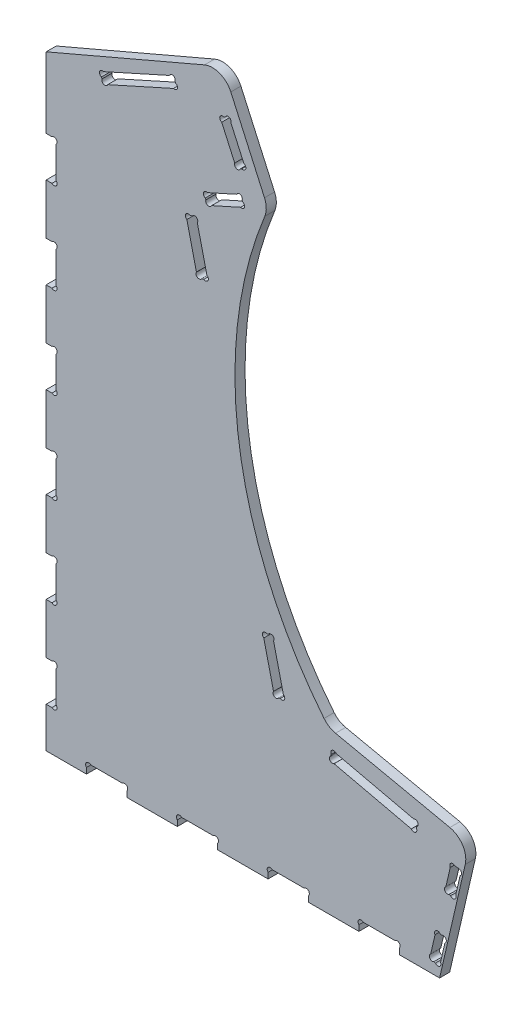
from build123d import *

# Parameters (mm, degrees)
SALIENTE_EXTRUIR3_DEPTH     = 10
CORTAR_EXTRUIR1_DEPTH       = 10
MATRIZL1_COUNT              = 4
MATRIZL1_PITCH              = 90
CROQUIS3_W                  = 10
CROQUIS3_H                  = 40
CORTAR_EXTRUIR2_DEPTH       = 788.723503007
CROQUIS4_R                  = 3
CORTAR_EXTRUIR3_DEPTH       = 788.723503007
MATRIZL2_COUNT              = 6
MATRIZL2_PITCH              = 90
CORTAR_EXTRUIR4_DEPTH       = 10
CORTAR_EXTRUIR5_DEPTH       = 788.723503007
MATRIZL3_COUNT              = 2
MATRIZL3_PITCH              = 67
CORTAR_EXTRUIR6_DEPTH       = 788.723503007
CORTAR_EXTRUIR7_DEPTH       = 788.723503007
CORTAR_EXTRUIR7_DEPTH_BACK  = 788.723503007
CROQUIS9_R                  = 3
CORTAR_EXTRUIR8_DEPTH       = 788.723503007
SIMETR_A2_COPY_1_SKETCH_R   = 3
SIMETR_A2_COPY_1_DEPTH      = 788.723503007
CROQUIS10_R                 = 3
CORTAR_EXTRUIR9_DEPTH       = 788.723503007
SIMETR_A4_COPY_1_SKETCH_R   = 3
SIMETR_A4_COPY_1_DEPTH      = 788.723503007
CORTAR_EXTRUIR10_DEPTH      = 788.723503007
CORTAR_EXTRUIR10_DEPTH_BACK = 788.723503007
CROQUIS12_R                 = 3
CORTAR_EXTRUIR11_DEPTH      = 788.723503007
SIMETR_A7_COPY_1_SKETCH_R   = 3
SIMETR_A7_COPY_1_DEPTH      = 788.723503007
CORTAR_EXTRUIR12_DEPTH      = 788.723503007
CORTAR_EXTRUIR12_DEPTH_BACK = 788.723503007
CROQUIS14_R                 = 3
CORTAR_EXTRUIR13_DEPTH      = 788.723503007
SIMETR_A9_COPY_1_SKETCH_R   = 3
SIMETR_A9_COPY_1_DEPTH      = 788.723503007
CROQUIS15_R                 = 3
CORTAR_EXTRUIR14_DEPTH      = 788.723503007
SIMETR_A11_COPY_1_SKETCH_R  = 3
SIMETR_A11_COPY_1_DEPTH     = 788.723503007
CORTAR_EXTRUIR15_DEPTH      = 788.723503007
CROQUIS17_R                 = 3
CORTAR_EXTRUIR16_DEPTH      = 788.723503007
SIMETR_A13_COPY_1_SKETCH_R  = 3
SIMETR_A13_COPY_1_DEPTH     = 788.723503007


with BuildPart() as part:
    # Croquis1 → Saliente-Extruir3 (new body)
    with BuildSketch(Plane.XY):
        with BuildLine():
            Line((390, 0), (0, 0))
            Line((0, 0), (0, 600))
            Line((0, 600), (156.944365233, 667.261870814))
            ThreePointArc((156.944365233, 667.261870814), (172.083493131, 667.514463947), (183.061181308, 657.08626376))
            Line((183.061181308, 657.08626376), (216.431669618, 582.92962307))
            ThreePointArc((216.431669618, 582.92962307), (218.190009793, 575.081743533), (216.714823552, 567.175745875))
            ThreePointArc((216.714823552, 567.175745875), (191.356561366, 358.362114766), (275.449490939, 165.555078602))
            ThreePointArc((275.449490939, 165.555078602), (280.54183744, 161.062862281), (286.843759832, 158.533480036))
            Line((286.843759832, 158.533480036), (400.13437653, 134.256919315))
            ThreePointArc((400.13437653, 134.256919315), (412.819999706, 125.433704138), (415.431618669, 110.2036809))
            Line((415.431618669, 110.2036809), (390, 0))
        make_face()
    extrude(amount=SALIENTE_EXTRUIR3_DEPTH)

    # Croquis2 → Cortar-Extruir1 (cut)
    with BuildSketch(Plane(origin=(496.247325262, 245.408483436, 0), x_dir=(-1, 0, 0), z_dir=(0, 0, -1))):
        with BuildLine():
            Line((456.247325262, -245.408483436), (416.247325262, -245.408483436))
            Line((416.247325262, -245.408483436), (416.247325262, -239.651124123))
            ThreePointArc((416.247325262, -239.651124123), (416.247325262, -235.408483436), (420.489965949, -235.408483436))
            Line((420.489965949, -235.408483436), (452.004684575, -235.408483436))
            ThreePointArc((452.004684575, -235.408483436), (456.247325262, -235.408483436), (456.247325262, -239.651124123))
            Line((456.247325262, -239.651124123), (456.247325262, -245.408483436))
        make_face()
    cortar_extruir1 = extrude(amount=-CORTAR_EXTRUIR1_DEPTH, mode=Mode.SUBTRACT)

    # MatrizL1: Cortar-Extruir1 ×4
    with Locations(*[(i * MATRIZL1_PITCH, 0, 0) for i in range(1, MATRIZL1_COUNT)]):
        add(cortar_extruir1, mode=Mode.SUBTRACT)

    # Croquis3 → Cortar-Extruir2 (cut, through all)
    with BuildSketch(Plane(origin=(0, 0, 0), x_dir=(-1, 0, 0), z_dir=(0, 0, -1))):
        with Locations((-5, 60)):
            Rectangle(CROQUIS3_W, CROQUIS3_H)
    cortar_extruir2 = extrude(amount=-CORTAR_EXTRUIR2_DEPTH, mode=Mode.SUBTRACT)

    # Croquis4 → Cortar-Extruir3 (cut, symmetric)
    with BuildSketch(Plane(origin=(0, 0, 0), x_dir=(-1, 0, 0), z_dir=(0, 0, -1))):
        with Locations((-7.878679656, 42.121320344)):
            Circle(CROQUIS4_R)
        with Locations((-7.878679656, 77.878679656)):
            Circle(CROQUIS4_R)
    cortar_extruir3 = extrude(amount=CORTAR_EXTRUIR3_DEPTH, both=True, mode=Mode.SUBTRACT)

    # MatrizL2: Cortar-Extruir2, Cortar-Extruir3 ×6
    with Locations(*[(0, i * MATRIZL2_PITCH, 0) for i in range(1, MATRIZL2_COUNT)]):
        add(cortar_extruir2, mode=Mode.SUBTRACT)
        add(cortar_extruir3, mode=Mode.SUBTRACT)

    # Croquis5 → Cortar-Extruir4 (cut)
    with BuildSketch(Plane.XY.offset(10)):
        Polygon((386.439724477, 39.044352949), (396.183636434, 36.795757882), (389.968640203, 9.864107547), (380.224728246, 12.112702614), align=None)
        Polygon((401.617741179, 104.815758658), (411.361653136, 102.567163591), (405.041364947, 75.179248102), (395.29745299, 77.427843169), align=None)
    extrude(amount=-CORTAR_EXTRUIR4_DEPTH, mode=Mode.SUBTRACT)

    # Croquis6 → Cortar-Extruir5 (cut, symmetric)
    with BuildSketch(Plane(origin=(0, 0, 0), x_dir=(-1, 0, 0), z_dir=(0, 0, -1))):
        with BuildLine():
            ThreePointArc((-390.64478447, 35.030172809), (-385.10654771, 37.174936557), (-391.02457835, 36.67594629))
            ThreePointArc((-391.02457835, 36.67594629), (-396.562815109, 34.531182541), (-390.64478447, 35.030172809))
        make_face()
        with BuildLine():
            ThreePointArc((-385.763580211, 13.878287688), (-379.845549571, 14.377277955), (-385.383786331, 12.232514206))
            ThreePointArc((-385.383786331, 12.232514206), (-391.30181697, 11.733523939), (-385.763580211, 13.878287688))
        make_face()
    cortar_extruir5 = extrude(amount=CORTAR_EXTRUIR5_DEPTH, both=True, mode=Mode.SUBTRACT)

    # MatrizL3: Cortar-Extruir5 ×2
    with Locations(*[Vector(0.2248595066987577, 0.9743911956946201, 0) * (i * MATRIZL3_PITCH) for i in range(1, MATRIZL3_COUNT)]):
        add(cortar_extruir5, mode=Mode.SUBTRACT)

    # Croquis7 → Cortar-Extruir6 (cut, through all)
    with BuildSketch(Plane.XY.offset(10)):
        Polygon((281.280428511, 132.585907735), (283.529023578, 142.329819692), (368.285922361, 122.770535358), (366.037327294, 113.026623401), align=None)
    extrude(amount=-CORTAR_EXTRUIR6_DEPTH, mode=Mode.SUBTRACT)

    # Croquis8 → Cortar-Extruir7 (cut, two sides: drawn at the far end of the back side and taken through both)
    with BuildSketch(Plane.XY.offset(10).offset(-CORTAR_EXTRUIR7_DEPTH_BACK)):
        Polygon((214.741242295, 208.899562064), (224.475329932, 211.190312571), (236.079041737, 161.882652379), (226.344954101, 159.591901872), align=None)
        Polygon((148.880563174, 532.415204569), (160.334315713, 483.744766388), (149.944860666, 481.299786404), (138.491108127, 529.970224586), align=None)
    extrude(amount=CORTAR_EXTRUIR7_DEPTH + CORTAR_EXTRUIR7_DEPTH_BACK, mode=Mode.SUBTRACT)

    # Croquis9 → Cortar-Extruir8 (cut, symmetric)
    with BuildSketch(Plane(origin=(0, 0, 0), x_dir=(-1, 0, 0), z_dir=(0, 0, -1))):
        with Locations((-365.741927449, 121.180538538)):
            Circle(CROQUIS9_R)
    cortar_extruir8 = extrude(amount=CORTAR_EXTRUIR8_DEPTH, both=True, mode=Mode.SUBTRACT)

    # Simetr_a1: Cortar-Extruir8 across plane
    add(cortar_extruir8.mirror(Plane(origin=(280.387112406, -64.704718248, 0), x_dir=(0, 0, 1), z_dir=(-0.9743911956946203, 0.22485950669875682, 0))), mode=Mode.SUBTRACT)

    # Simetr_a2: Cortar-Extruir8 across plane
    add(cortar_extruir8.mirror(Plane(origin=(44.396063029, 192.382939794, 0), x_dir=(0, 0, 1), z_dir=(-0.22485950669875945, -0.9743911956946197, 0))), mode=Mode.SUBTRACT)

    # Simetr_a2 copy 1 sketch → Simetr_a2 copy 1 (cut, symmetric)
    with BuildSketch(Plane(origin=(649.566350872, 255.356443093, 0), x_dir=(1, 0, 0), z_dir=(0, 0, -1))):
        with Locations((-365.741927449, 121.180538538)):
            Circle(SIMETR_A2_COPY_1_SKETCH_R)
    extrude(amount=SIMETR_A2_COPY_1_DEPTH, both=True, mode=Mode.SUBTRACT)

    # Croquis10 → Cortar-Extruir9 (cut, symmetric)
    with BuildSketch(Plane(origin=(0, 0, 0), x_dir=(-1, 0, 0), z_dir=(0, 0, -1))):
        with Locations((-233.528188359, 163.461622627)):
            Circle(CROQUIS10_R)
    cortar_extruir9 = extrude(amount=CORTAR_EXTRUIR9_DEPTH, both=True, mode=Mode.SUBTRACT)

    # Simetr_a3: Cortar-Extruir9 across plane
    add(cortar_extruir9.mirror(Plane(origin=(254.920847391, 59.991247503, 0), x_dir=(0, 0, 1), z_dir=(-0.9734087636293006, -0.22907505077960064, 0))), mode=Mode.SUBTRACT)

    # Simetr_a4: Cortar-Extruir9 across plane
    add(cortar_extruir9.mirror(Plane(origin=(-29.510705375, 125.399859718, 0), x_dir=(0, 0, 1), z_dir=(-0.22907505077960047, 0.9734087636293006, 0))), mode=Mode.SUBTRACT)

    # Simetr_a4 copy 1 sketch → Simetr_a4 copy 1 (cut, symmetric)
    with BuildSketch(Plane(origin=(450.820284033, 370.782214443, 0), x_dir=(1, 0, 0), z_dir=(0, 0, -1))):
        with Locations((-233.528188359, 163.461622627)):
            Circle(SIMETR_A4_COPY_1_SKETCH_R)
    extrude(amount=SIMETR_A4_COPY_1_DEPTH, both=True, mode=Mode.SUBTRACT)

    # Croquis11 → Cortar-Extruir10 (cut, two sides: drawn at the far end of the back side and taken through both)
    with BuildSketch(Plane.XY.offset(10).offset(-CORTAR_EXTRUIR10_DEPTH_BACK)):
        Polygon((53.038071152, 609.709569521), (125.991791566, 642.538743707), (130.095438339, 633.419528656), (57.141717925, 600.590354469), align=None)
    extrude(amount=CORTAR_EXTRUIR10_DEPTH + CORTAR_EXTRUIR10_DEPTH_BACK, mode=Mode.SUBTRACT)

    # Croquis12 → Cortar-Extruir11 (cut, symmetric)
    with BuildSketch(Plane(origin=(0, 0, 0), x_dir=(-1, 0, 0), z_dir=(0, 0, -1))):
        with Locations((-127.29044576, 634.483491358)):
            Circle(CROQUIS12_R)
    cortar_extruir11 = extrude(amount=CORTAR_EXTRUIR11_DEPTH, both=True, mode=Mode.SUBTRACT)

    # Simetr_a6: Cortar-Extruir11 across plane
    add(cortar_extruir11.mirror(Plane(origin=(308.749107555, 138.9370984, 0), x_dir=(0, 0, 1), z_dir=(-0.9119215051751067, -0.41036467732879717, 0))), mode=Mode.SUBTRACT)

    # Simetr_a7: Cortar-Extruir11 across plane
    add(cortar_extruir11.mirror(Plane(origin=(-217.18235281, 482.627450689, 0), x_dir=(0, 0, 1), z_dir=(-0.41036467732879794, 0.9119215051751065, 0))), mode=Mode.SUBTRACT)

    # Simetr_a7 copy 1 sketch → Simetr_a7 copy 1 (cut, symmetric)
    with BuildSketch(Plane(origin=(183.13350949, 1243.129098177, 0), x_dir=(1, 0, 0), z_dir=(0, 0, -1))):
        with Locations((-127.29044576, 634.483491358)):
            Circle(SIMETR_A7_COPY_1_SKETCH_R)
    extrude(amount=SIMETR_A7_COPY_1_DEPTH, both=True, mode=Mode.SUBTRACT)

    # Croquis13 → Cortar-Extruir12 (cut, two sides: drawn at the far end of the back side and taken through both)
    with BuildSketch(Plane.XY.offset(10).offset(-CORTAR_EXTRUIR12_DEPTH_BACK)):
        Polygon((172.269732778, 630.466248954), (181.38894783, 634.569895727), (197.760021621, 598.189731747), (188.640806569, 594.086084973), align=None)
    extrude(amount=CORTAR_EXTRUIR12_DEPTH + CORTAR_EXTRUIR12_DEPTH_BACK, mode=Mode.SUBTRACT)

    # Croquis14 → Cortar-Extruir13 (cut, symmetric)
    with BuildSketch(Plane(origin=(0, 0, 0), x_dir=(-1, 0, 0), z_dir=(0, 0, -1))):
        with Locations((-194.955029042, 599.253694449)):
            Circle(CROQUIS14_R)
    cortar_extruir13 = extrude(amount=CORTAR_EXTRUIR13_DEPTH, both=True, mode=Mode.SUBTRACT)

    # Simetr_a8: Cortar-Extruir13 across plane
    add(cortar_extruir13.mirror(Plane(origin=(383.752576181, 172.688659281, 0), x_dir=(0, 0, 1), z_dir=(-0.9119215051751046, -0.4103646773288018, 0))), mode=Mode.SUBTRACT)

    # Simetr_a9: Cortar-Extruir13 across plane
    add(cortar_extruir13.mirror(Plane(origin=(-198.737698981, 441.639331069, 0), x_dir=(0, 0, 1), z_dir=(0.410364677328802, -0.9119215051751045, 0))), mode=Mode.SUBTRACT)

    # Simetr_a9 copy 1 sketch → Simetr_a9 copy 1 (cut, symmetric)
    with BuildSketch(Plane(origin=(370.029754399, 1228.6559807, 0), x_dir=(1, 0, 0), z_dir=(0, 0, -1))):
        with Locations((-194.955029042, 599.253694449)):
            Circle(SIMETR_A9_COPY_1_SKETCH_R)
    extrude(amount=SIMETR_A9_COPY_1_DEPTH, both=True, mode=Mode.SUBTRACT)

    # Croquis15 → Cortar-Extruir14 (cut, symmetric)
    with BuildSketch(Plane(origin=(0, 0, 0), x_dir=(-1, 0, 0), z_dir=(0, 0, -1))):
        with Locations((-157.783462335, 485.323736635)):
            Circle(CROQUIS15_R)
    cortar_extruir14 = extrude(amount=CORTAR_EXTRUIR14_DEPTH, both=True, mode=Mode.SUBTRACT)

    # Simetr_a10: Cortar-Extruir14 across plane
    add(cortar_extruir14.mirror(Plane(origin=(-105.180451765, 446.943362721, 0), x_dir=(0, 0, 1), z_dir=(0.22907505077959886, -0.973408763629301, 0))), mode=Mode.SUBTRACT)

    # Simetr_a11: Cortar-Extruir14 across plane
    add(cortar_extruir14.mirror(Plane(origin=(254.593163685, 59.914132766, 0), x_dir=(0, 0, 1), z_dir=(-0.9734087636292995, -0.2290750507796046, 0))), mode=Mode.SUBTRACT)

    # Simetr_a11 copy 1 sketch → Simetr_a11 copy 1 (cut, symmetric)
    with BuildSketch(Plane(origin=(298.82542384, 1013.714990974, 0), x_dir=(1, 0, 0), z_dir=(0, 0, -1))):
        with Locations((-157.783462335, 485.323736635)):
            Circle(SIMETR_A11_COPY_1_SKETCH_R)
    extrude(amount=SIMETR_A11_COPY_1_DEPTH, both=True, mode=Mode.SUBTRACT)

    # Croquis16 → Cortar-Extruir15 (cut, through all)
    with BuildSketch(Plane.XY.offset(10)):
        Polygon((160.113713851, 548.235047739), (196.590574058, 564.649634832), (192.486927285, 573.768849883), (156.010067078, 557.35426279), align=None)
    extrude(amount=-CORTAR_EXTRUIR15_DEPTH, mode=Mode.SUBTRACT)

    # Croquis17 → Cortar-Extruir16 (cut, symmetric)
    with BuildSketch(Plane(origin=(0, 0, 0), x_dir=(-1, 0, 0), z_dir=(0, 0, -1))):
        with Locations((-193.785581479, 565.713597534)):
            Circle(CROQUIS17_R)
    cortar_extruir16 = extrude(amount=CORTAR_EXTRUIR16_DEPTH, both=True, mode=Mode.SUBTRACT)

    # Simetr_a12: Cortar-Extruir16 across plane
    add(cortar_extruir16.mirror(Plane(origin=(356.549852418, 160.447433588, 0), x_dir=(0, 0, 1), z_dir=(-0.9119215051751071, -0.41036467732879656, 0))), mode=Mode.SUBTRACT)

    # Simetr_a13: Cortar-Extruir16 across plane
    add(cortar_extruir16.mirror(Plane(origin=(-180.24953185, 400.554515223, 0), x_dir=(0, 0, 1), z_dir=(0.4103646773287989, -0.911921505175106, 0))), mode=Mode.SUBTRACT)

    # Simetr_a13 copy 1 sketch → Simetr_a13 copy 1 (cut, symmetric)
    with BuildSketch(Plane(origin=(352.600641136, 1122.003897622, 0), x_dir=(1, 0, 0), z_dir=(0, 0, -1))):
        with Locations((-193.785581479, 565.713597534)):
            Circle(SIMETR_A13_COPY_1_SKETCH_R)
    extrude(amount=SIMETR_A13_COPY_1_DEPTH, both=True, mode=Mode.SUBTRACT)


solid = part.part
